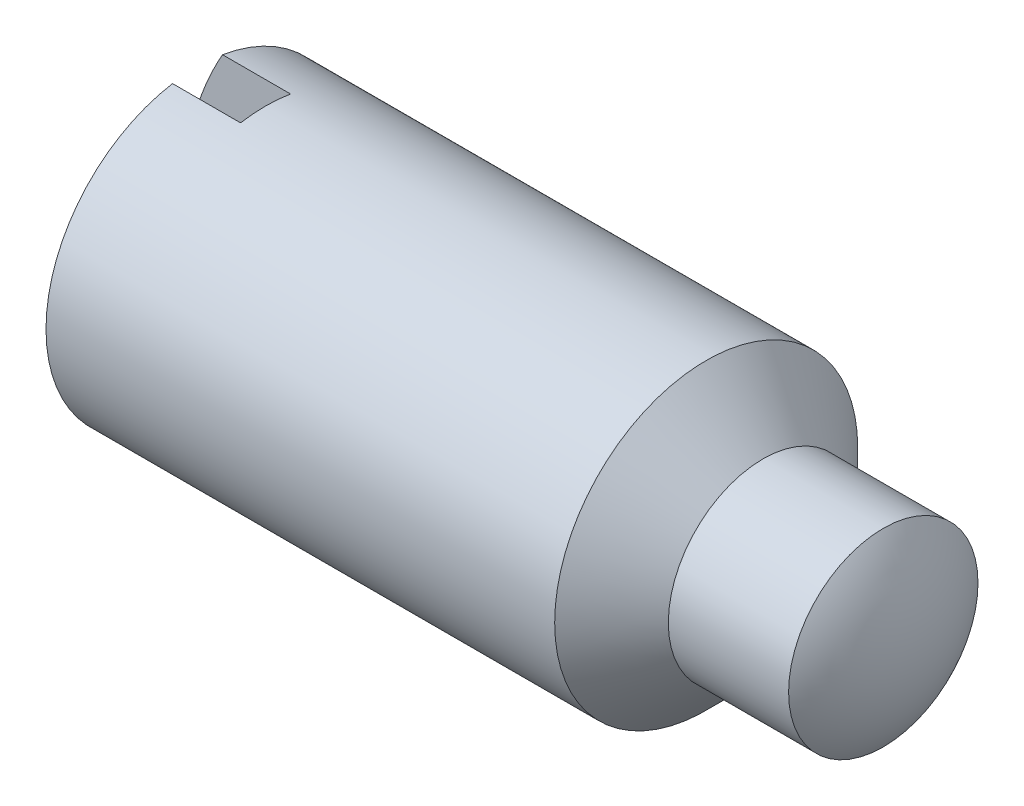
from build123d import *

# Parameters (mm, degrees)
SLOT_DEPTH      = 11.392304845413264
SLOT_DEPTH_BACK = 11.392304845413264


with BuildPart() as part:
    # Sketch1 → Base (revolve)
    with BuildSketch(Plane(origin=(11.146889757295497, 0, 2.0000000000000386), x_dir=(1, 0, 0), z_dir=(0, 1, 0)), mode=Mode.PRIVATE) as base_sk:
        with BuildLine():
            Line((-1.146889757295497, 2.0000000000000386), (-11.146889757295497, 2.0000000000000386))
            ThreePointArc((-11.146889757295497, 2.0000000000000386), (-11.010593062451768, 3.035276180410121), (-10.61099137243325, 4.000000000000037))
            Line((-10.61099137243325, 4.000000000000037), (-3.896889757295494, 4.000000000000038))
            Line((-3.896889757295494, 4.000000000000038), (-3.1468897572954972, 3.2500000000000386))
            Line((-3.1468897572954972, 3.2500000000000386), (-1.5594360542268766, 3.2500000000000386))
            ThreePointArc((-1.5594360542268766, 3.2500000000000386), (-1.2526915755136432, 2.6581592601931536), (-1.146889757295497, 2.0000000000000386))
        make_face()
    revolve(base_sk.sketch.rotate(Axis((-4.179393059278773, 0, 0), (1, 0, 0)), 180), axis=Axis((-4.179393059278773, 0, 0), (1, 0, 0)))

    # Sketch2 → Slot (cut, two sides: drawn at the far end of the back side and taken through both)
    with BuildSketch(Plane(origin=(0, 0, 0), x_dir=(1, 0, 0), z_dir=(0, 1, 0)).offset(-SLOT_DEPTH_BACK)):
        with BuildLine():
            Line((1.4336357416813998, 0.33000000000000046), (0.01363574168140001, 0.33000000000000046))
            ThreePointArc((0.01363574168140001, 0.33000000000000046), (-0.31636425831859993, 5.3e-16), (0.01363574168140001, -0.3299999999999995))
            Line((0.01363574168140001, -0.3299999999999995), (1.4336357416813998, -0.3299999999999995))
            Line((1.4336357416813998, -0.3299999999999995), (1.4336357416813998, 0.33000000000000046))
        make_face()
    extrude(amount=SLOT_DEPTH + SLOT_DEPTH_BACK, mode=Mode.SUBTRACT)


solid = part.part
